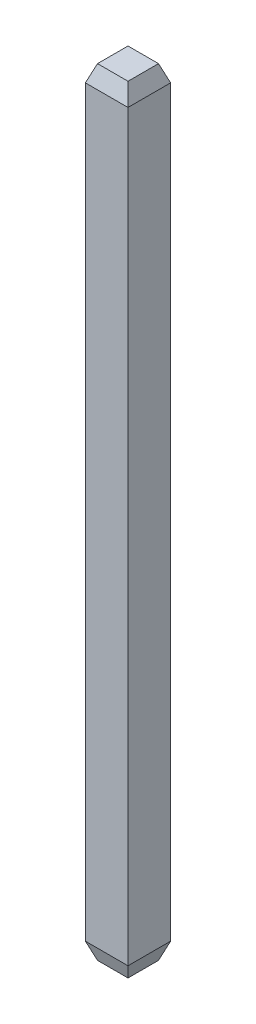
from build123d import *
from OCP.BRepFilletAPI import BRepFilletAPI_MakeChamfer

# Parameters (mm, degrees)
SKETCH_1_W      = 0.64
SKETCH_1_H      = 0.64
EXTRUDE_1_DEPTH = 11.66
CHAMFER_1_SIZE  = 0.25
CHAMFER_1_SIZE2 = 0.090992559
CHAMFER_2_SIZE  = 0.25
CHAMFER_2_SIZE2 = 0.090992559


with BuildPart() as part:
    # Sketch 1 → Extrude 1 (new body)
    with BuildSketch(Plane(origin=(0, 0, 0), x_dir=(1, 0, 0), z_dir=(0, 1, 0))):
        Rectangle(SKETCH_1_W, SKETCH_1_H)
    extrude(amount=EXTRUDE_1_DEPTH)

    # Chamfer 1: one chamfer whose edges measure the first distance from different faces: ONE call of the kernel's chamfer builder (chamfer() names one face for all edges)
    chamfer_1_edges_1 = [part.edges().sort_by_distance(p)[0] for p in [
        (-0.32, 11.66, 0),
    ]]
    chamfer_1_side_1 = [part.faces().sort_by_distance(p)[0] for p in [
        (-0.32, 5.83, 0),
    ]]
    chamfer_1_edges_2 = [part.edges().sort_by_distance(p)[0] for p in [
        (0, 11.66, 0.32),
    ]]
    chamfer_1_side_2 = [part.faces().sort_by_distance(p)[0] for p in [
        (0, 5.83, 0.32),
    ]]
    chamfer_1_edges_3 = [part.edges().sort_by_distance(p)[0] for p in [
        (0.32, 11.66, 0),
    ]]
    chamfer_1_side_3 = [part.faces().sort_by_distance(p)[0] for p in [
        (0.32, 5.83, 0),
    ]]
    chamfer_1_edges_4 = [part.edges().sort_by_distance(p)[0] for p in [
        (0, 11.66, -0.32),
    ]]
    chamfer_1_side_4 = [part.faces().sort_by_distance(p)[0] for p in [
        (0, 5.83, -0.32),
    ]]
    chamfer_1 = BRepFilletAPI_MakeChamfer(part.part.solid().wrapped)
    for e in chamfer_1_edges_1:
        chamfer_1.Add(CHAMFER_1_SIZE, CHAMFER_1_SIZE2, e.wrapped, chamfer_1_side_1[0].wrapped)  # the first distance lies on this face
    for e in chamfer_1_edges_2:
        chamfer_1.Add(CHAMFER_1_SIZE, CHAMFER_1_SIZE2, e.wrapped, chamfer_1_side_2[0].wrapped)  # the first distance lies on this face
    for e in chamfer_1_edges_3:
        chamfer_1.Add(CHAMFER_1_SIZE, CHAMFER_1_SIZE2, e.wrapped, chamfer_1_side_3[0].wrapped)  # the first distance lies on this face
    for e in chamfer_1_edges_4:
        chamfer_1.Add(CHAMFER_1_SIZE, CHAMFER_1_SIZE2, e.wrapped, chamfer_1_side_4[0].wrapped)  # the first distance lies on this face
    add(Compound.cast(chamfer_1.Shape()), mode=Mode.REPLACE)

    # Chamfer 2: one chamfer whose edges measure the first distance from different faces: ONE call of the kernel's chamfer builder (chamfer() names one face for all edges)
    chamfer_2_edges_1 = [part.edges().sort_by_distance(p)[0] for p in [
        (0, 0, 0.32),
    ]]
    chamfer_2_side_1 = [part.faces().sort_by_distance(p)[0] for p in [
        (0, 5.705, 0.32),
    ]]
    chamfer_2_edges_2 = [part.edges().sort_by_distance(p)[0] for p in [
        (-0.32, 0, 0),
    ]]
    chamfer_2_side_2 = [part.faces().sort_by_distance(p)[0] for p in [
        (-0.32, 5.705, 0),
    ]]
    chamfer_2_edges_3 = [part.edges().sort_by_distance(p)[0] for p in [
        (0, 0, -0.32),
    ]]
    chamfer_2_side_3 = [part.faces().sort_by_distance(p)[0] for p in [
        (0, 5.705, -0.32),
    ]]
    chamfer_2_edges_4 = [part.edges().sort_by_distance(p)[0] for p in [
        (0.32, 0, 0),
    ]]
    chamfer_2_side_4 = [part.faces().sort_by_distance(p)[0] for p in [
        (0.32, 5.705, 0),
    ]]
    chamfer_2 = BRepFilletAPI_MakeChamfer(part.part.solid().wrapped)
    for e in chamfer_2_edges_1:
        chamfer_2.Add(CHAMFER_2_SIZE, CHAMFER_2_SIZE2, e.wrapped, chamfer_2_side_1[0].wrapped)  # the first distance lies on this face
    for e in chamfer_2_edges_2:
        chamfer_2.Add(CHAMFER_2_SIZE, CHAMFER_2_SIZE2, e.wrapped, chamfer_2_side_2[0].wrapped)  # the first distance lies on this face
    for e in chamfer_2_edges_3:
        chamfer_2.Add(CHAMFER_2_SIZE, CHAMFER_2_SIZE2, e.wrapped, chamfer_2_side_3[0].wrapped)  # the first distance lies on this face
    for e in chamfer_2_edges_4:
        chamfer_2.Add(CHAMFER_2_SIZE, CHAMFER_2_SIZE2, e.wrapped, chamfer_2_side_4[0].wrapped)  # the first distance lies on this face
    add(Compound.cast(chamfer_2.Shape()), mode=Mode.REPLACE)


solid = part.part
